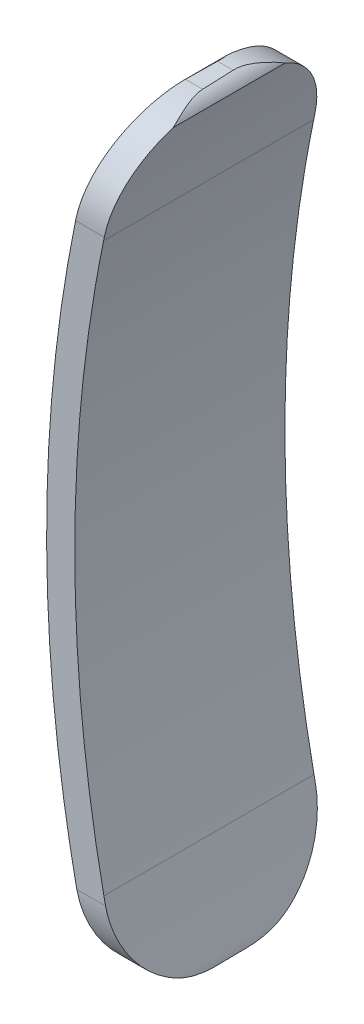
from build123d import *

# Parameters (mm, degrees)
BOSS_EXTRUDE1_DEPTH = 25.4
SKETCH4_W           = 124.519493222
SKETCH4_H           = 158.412373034
CUT_EXTRUDE1_DEPTH  = 111.995423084


with BuildPart() as part:
    # Sketch2 → Boss-Extrude1 (new, symmetric)
    with BuildSketch(Plane.XY):
        with BuildLine():
            ThreePointArc((-4.064360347, 107.178081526), (-1.903709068, 107.311788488), (-0.281352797, 105.878522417))
            add(Edge.make_bspline(
                [(-0.281352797, 105.878522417), (-0.300885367, 105.811716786), (-0.332172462, 105.702614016), (-0.449361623, 105.286135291), (-0.648308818, 104.560947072), (-0.970117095, 103.350138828), (-1.478410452, 101.36865741), (-2.076341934, 98.898278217), (-2.687572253, 96.167334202), (-2.988608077, 94.746727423), (-3.133720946, 94.042067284)],
                knots=[0, 0, 0, 0, 0.055316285, 0.110632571, 0.221265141, 0.331897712, 0.442530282, 0.663795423, 0.774427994, 0.885060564, 0.885060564, 0.885060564, 0.885060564], degree=3))
            add(Edge.make_bspline(
                [(-3.133720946, 94.042067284), (-4.496271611, 87.425595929), (-6.549022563, 74.043975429), (-7.571275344, 53.770054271), (-6.528724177, 33.497166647), (-4.462576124, 20.117607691), (-3.093401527, 13.502503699)],
                knots=[-0.203077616, -0.203077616, -0.203077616, -0.203077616, -0.101288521, 0.000500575, 0.10228967, 0.204078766, 0.204078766, 0.204078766, 0.204078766], degree=3))
            add(Edge.make_bspline(
                [(-3.093401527, 13.502503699), (-2.927506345, 12.700988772), (-2.582270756, 11.081923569), (-2.060262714, 8.767355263), (-1.553858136, 6.629743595), (-1.088308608, 4.744558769), (-0.752193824, 3.427019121), (-0.530525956, 2.570640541), (-0.389470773, 2.029286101), (-0.29307405, 1.659799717), (-0.230900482, 1.420298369), (-0.191373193, 1.266963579), (-0.163649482, 1.1580168), (-0.143842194, 1.078781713), (-0.1296056, 1.020869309), (-0.11489339, 0.95926141), (-0.100391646, 0.896391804), (-0.083745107, 0.818157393), (-0.069270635, 0.745569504), (-0.052705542, 0.650322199), (-0.036791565, 0.548001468), (-0.019448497, 0.404145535), (-0.005158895, 0.23138931), (0, 0.070986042), (0, 0)],
                knots=[0, 0, 0, 0, 0.125, 0.25, 0.375, 0.5, 0.625, 0.6875, 0.75, 0.8125, 0.84375, 0.875, 0.90625, 0.921875, 0.9375, 0.953125, 0.96875, 0.9765625, 0.984375, 0.98828125, 0.9921875, 0.99609375, 0.998046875, 1, 1, 1, 1], degree=3))
            ThreePointArc((0, 0), (-2, -0.828427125), (-4, 0))
            add(Edge.make_bspline(
                [(-4, 0), (-4, 0.010840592), (-4.022860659, 0.104699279), (-4.089397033, 0.364350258), (-4.11698115, 0.470859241), (-4.182974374, 0.724588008), (-4.221453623, 0.872076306), (-4.350077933, 1.365453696), (-4.453990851, 1.764404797), (-4.634618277, 2.46604274), (-4.699359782, 2.718744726), (-4.834743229, 3.250950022), (-4.90536449, 3.530354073), (-5.125192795, 4.407339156), (-5.282285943, 5.043296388), (-5.615271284, 6.421407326), (-5.786507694, 7.144445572), (-6.047116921, 8.272716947), (-6.134704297, 8.656473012), (-6.311140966, 9.439785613), (-6.400390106, 9.841191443), (-6.665508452, 11.050348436), (-6.839475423, 11.866058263), (-7.010380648, 12.691778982)],
                knots=[0, 0, 0, 0, 0.125, 0.125, 0.1875, 0.1875, 0.25, 0.25, 0.375, 0.375, 0.4375, 0.4375, 0.5, 0.5, 0.625, 0.625, 0.75, 0.75, 0.8125, 0.8125, 0.875, 0.875, 1, 1, 1, 1], degree=3))
            add(Edge.make_bspline(
                [(-7.051509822, 94.848869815), (-15.51181749, 53.766079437), (-7.010380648, 12.691778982)],
                knots=[6.080107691, 6.080107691, 6.080107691, 6.487264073, 6.487264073, 6.487264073], degree=2, weights=[1, 0.979349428, 1]))
            add(Edge.make_bspline(
                [(-7.051509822, 94.848869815), (-6.881463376, 95.674606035), (-6.709104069, 96.484523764), (-6.447636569, 97.676818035), (-6.359996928, 98.070459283), (-6.183898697, 98.850040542), (-6.09512416, 99.237289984), (-5.833463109, 100.363199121), (-5.66353333, 101.073767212), (-5.417132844, 102.080536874), (-5.336288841, 102.406766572), (-5.178520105, 103.036352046), (-5.102618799, 103.335646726), (-4.884141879, 104.188567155), (-4.750699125, 104.697659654), (-4.571557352, 105.370114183), (-4.515280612, 105.579269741), (-4.41270279, 105.957391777), (-4.319411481, 106.297932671), (-4.244999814, 106.564544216), (-4.180404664, 106.793719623), (-4.152950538, 106.889811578), (-4.08667747, 107.118033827), (-4.064360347, 107.188919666), (-4.064360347, 107.178081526)],
                knots=[0, 0, 0, 0, 0.125, 0.125, 0.1875, 0.1875, 0.25, 0.25, 0.375, 0.375, 0.4375, 0.4375, 0.5, 0.5, 0.625, 0.625, 0.6875, 0.6875, 0.75, 0.8125, 0.8125, 0.875, 0.875, 1, 1, 1, 1], degree=3))
        make_face()
    extrude(amount=BOSS_EXTRUDE1_DEPTH, both=True)

    # Sketch4 → Cut-Extrude1 (cut, through all)
    with BuildSketch(Plane(origin=(0, 0, 0), x_dir=(0, 0, -1), z_dir=(1, 0, 0))):
        with Locations((2.679705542, 48.429583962)):
            Rectangle(SKETCH4_W, SKETCH4_H)
        with BuildLine():
            Line((-2.222316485, 0), (2.222316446, 0.057123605))
            add(Edge.make_bspline(
                [(2.222316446, 0.057123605), (3.065793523, 0.067964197), (3.893404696, 0.161822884), (5.112127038, 0.421473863), (5.514557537, 0.527982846), (6.311655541, 0.781711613), (6.706152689, 0.929199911), (7.851644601, 1.422577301), (8.574215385, 1.821528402), (9.597800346, 2.523166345), (9.930541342, 2.775868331), (10.564740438, 3.308073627), (10.866539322, 3.587477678), (11.727491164, 4.464462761), (12.242653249, 5.100419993), (13.152063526, 6.478530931), (13.533340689, 7.201569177), (13.995441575, 8.329840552), (14.131244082, 8.713596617), (14.36538796, 9.496909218), (14.463987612, 9.898315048), (14.696952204, 11.107472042), (14.770859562, 11.923181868), (14.76024718, 12.748902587)],
                knots=[0, 0, 0, 0, 0.125, 0.125, 0.1875, 0.1875, 0.25, 0.25, 0.375, 0.375, 0.4375, 0.4375, 0.5, 0.5, 0.625, 0.625, 0.75, 0.75, 0.8125, 0.8125, 0.875, 0.875, 1, 1, 1, 1], degree=3))
            Line((14.76024718, 12.748902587), (14.76024718, 94.912778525))
            add(Edge.make_bspline(
                [(14.76024718, 94.912778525), (14.749634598, 95.738514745), (14.657224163, 96.548432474), (14.401401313, 97.740726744), (14.296446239, 98.134367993), (14.046356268, 98.913949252), (13.900449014, 99.301198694), (13.410947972, 100.427107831), (13.014302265, 101.137675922), (12.314825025, 102.144445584), (12.063648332, 102.470675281), (11.526791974, 103.100260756), (11.24467163, 103.399555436), (10.358461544, 104.252475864), (9.714905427, 104.761568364), (8.668255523, 105.434022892), (8.304606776, 105.643178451), (7.565733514, 106.021300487), (6.811669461, 106.361841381), (6.027658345, 106.628452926), (5.228455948, 106.857628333), (4.820026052, 106.953720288), (3.579238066, 107.181942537), (2.74402633, 107.252828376), (1.900740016, 107.241990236)],
                knots=[0, 0, 0, 0, 0.125, 0.125, 0.1875, 0.1875, 0.25, 0.25, 0.375, 0.375, 0.4375, 0.4375, 0.5, 0.5, 0.625, 0.625, 0.6875, 0.6875, 0.75, 0.8125, 0.8125, 0.875, 0.875, 1, 1, 1, 1], degree=3))
            Line((1.900740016, 107.241990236), (-2.543892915, 107.184866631))
            add(Edge.make_bspline(
                [(-2.543892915, 107.184866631), (-3.387003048, 107.174030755), (-4.21466207, 107.081817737), (-5.433970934, 106.826573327), (-5.836683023, 106.721856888), (-6.634497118, 106.472256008), (-7.029936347, 106.326931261), (-8.178512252, 105.840181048), (-8.903355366, 105.445995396), (-9.930058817, 104.750990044), (-10.26379403, 104.500465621), (-10.901273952, 103.970772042), (-11.204374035, 103.692479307), (-12.068195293, 102.818366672), (-12.583875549, 102.18369129), (-13.264750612, 101.151215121), (-13.474226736, 100.796169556), (-13.854067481, 100.073364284), (-14.196528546, 99.335253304), (-14.465067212, 98.56674654), (-14.695985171, 97.782718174), (-14.792899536, 97.381080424), (-15.021411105, 96.170854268), (-15.092898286, 95.354775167), (-15.082288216, 94.529234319)],
                knots=[0, 0, 0, 0, 0.125, 0.125, 0.1875, 0.1875, 0.25, 0.25, 0.375, 0.375, 0.4375, 0.4375, 0.5, 0.5, 0.625, 0.625, 0.6875, 0.6875, 0.75, 0.8125, 0.8125, 0.875, 0.875, 1, 1, 1, 1], degree=3))
            Line((-15.082288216, 94.529234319), (-15.082288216, 12.365358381))
            add(Edge.make_bspline(
                [(-15.082288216, 12.365358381), (-15.071671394, 11.539292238), (-14.976832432, 10.729648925), (-14.716499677, 9.53815402), (-14.609883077, 9.144846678), (-14.356512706, 8.366004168), (-14.209049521, 7.979340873), (-13.715517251, 6.854996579), (-13.316876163, 6.144946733), (-12.616188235, 5.137764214), (-12.364606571, 4.810864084), (-11.828944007, 4.181088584), (-11.547629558, 3.881281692), (-10.664296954, 3.025777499), (-10.023285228, 2.513557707), (-8.980531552, 1.835226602), (-8.618114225, 1.623863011), (-7.88156677, 1.241289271), (-7.505655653, 1.068771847), (-6.35521275, 0.606907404), (-5.556625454, 0.372386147), (-3.90162836, 0.061702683), (-3.066047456, -0.010843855), (-2.222316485, 0)],
                knots=[0, 0, 0, 0, 0.125, 0.125, 0.1875, 0.1875, 0.25, 0.25, 0.375, 0.375, 0.4375, 0.4375, 0.5, 0.5, 0.625, 0.625, 0.6875, 0.6875, 0.75, 0.75, 0.875, 0.875, 1, 1, 1, 1], degree=3))
        make_face(mode=Mode.SUBTRACT)
    extrude(amount=-CUT_EXTRUDE1_DEPTH, mode=Mode.SUBTRACT)


solid = part.part
